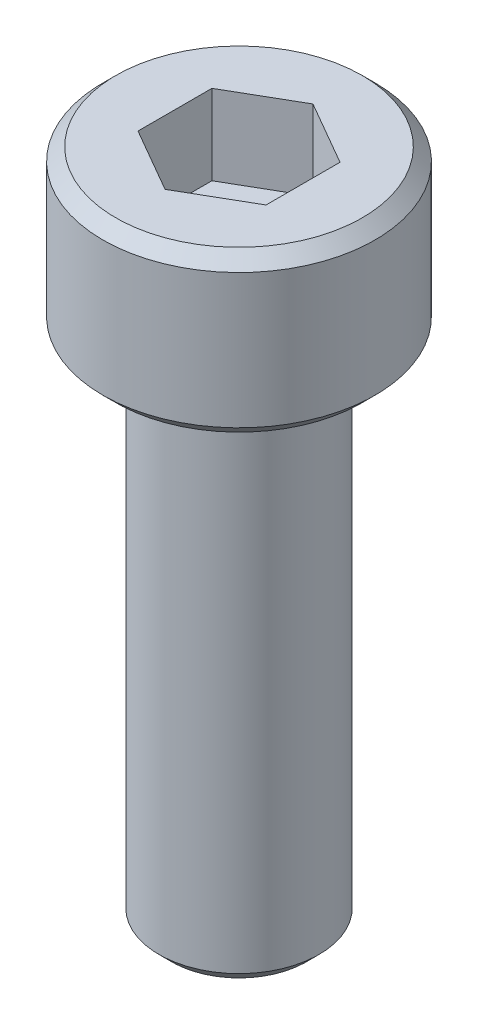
from build123d import *

# Parameters (mm, degrees)
CHANFREIN1_SIZE         = 0.4
ENL_V_MAT_EXTRU_1_DEPTH = 2.5


with BuildPart() as part:
    # Esquisse1 → R_volution1 (revolve)
    with BuildSketch(Plane.XY, mode=Mode.PRIVATE) as r_volution1_sk:
        Polygon((0, 0), (2.5, 0), (2.5, 16), (4.25, 16), (4.25, 21), (0, 21), align=None)
    revolve(r_volution1_sk.sketch.rotate(Axis((0, 0, 0), (0, 1, 0)), 90), axis=Axis((0, 0, 0), (0, 1, 0)))

    # Chanfrein1
    chanfrein1_edges = [part.edges().sort_by_distance(p)[0] for p in [
        (0, 21, 4.25),
        (0, 16, 4.25),
        (0, 0, 2.5),
    ]]
    chamfer(chanfrein1_edges, length=CHANFREIN1_SIZE)

    # Esquisse2 → Enl_v. mat.-Extru.1 (cut)
    with BuildSketch(Plane(origin=(0, 21, 0), x_dir=(-1, 0, 0), z_dir=(0, 1, 0))):
        Polygon((-2, 1.154700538), (-2, -1.154700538), (0, -2.309401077), (2, -1.154700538), (2, 1.154700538), (0, 2.309401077), align=None)
    extrude(amount=-ENL_V_MAT_EXTRU_1_DEPTH, mode=Mode.SUBTRACT)


solid = part.part
